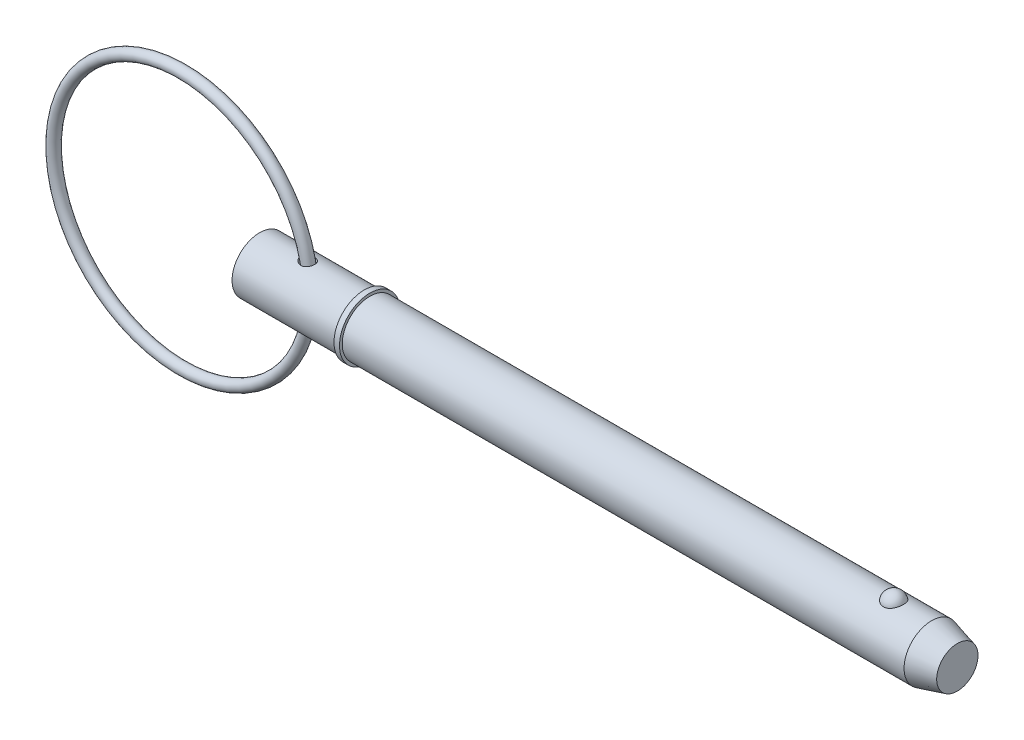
ISO-10303-21;
HEADER;
FILE_DESCRIPTION(('STEP AP214'),'2;1');
FILE_NAME('part.step','',(''),(''),'','','');
FILE_SCHEMA(('AUTOMOTIVE_DESIGN { 1 0 10303 214 1 1 1 1 }'));
ENDSEC;
DATA;
#1=APPLICATION_CONTEXT('core data for automotive mechanical design processes');
#2=APPLICATION_PROTOCOL_DEFINITION('international standard','automotive_design',2000,#1);
#3=PRODUCT_CONTEXT('',#1,'mechanical');
#4=PRODUCT('Part','Part','',(#3));
#5=PRODUCT_RELATED_PRODUCT_CATEGORY('part','',(#4));
#6=PRODUCT_DEFINITION_FORMATION('','',#4);
#7=PRODUCT_DEFINITION_CONTEXT('part definition',#1,'design');
#8=PRODUCT_DEFINITION('design','',#6,#7);
#9=PRODUCT_DEFINITION_SHAPE('','',#8);
#10=(LENGTH_UNIT() NAMED_UNIT(*) SI_UNIT(.MILLI.,.METRE.));
#11=(NAMED_UNIT(*) PLANE_ANGLE_UNIT() SI_UNIT($,.RADIAN.));
#12=(NAMED_UNIT(*) SI_UNIT($,.STERADIAN.) SOLID_ANGLE_UNIT());
#13=UNCERTAINTY_MEASURE_WITH_UNIT(LENGTH_MEASURE(1.E-05),#10,'distance_accuracy_value','');
#14=(GEOMETRIC_REPRESENTATION_CONTEXT(3) GLOBAL_UNCERTAINTY_ASSIGNED_CONTEXT((#13)) GLOBAL_UNIT_ASSIGNED_CONTEXT((#10,
#11,#12)) REPRESENTATION_CONTEXT('',''));
#15=CARTESIAN_POINT('',(0.,0.,0.));
#16=DIRECTION('',(0.,0.,1.));
#17=DIRECTION('',(1.,0.,0.));
#18=AXIS2_PLACEMENT_3D('',#15,#16,#17);
#19=CARTESIAN_POINT('',(-13.4013067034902,0.,0.));
#20=DIRECTION('',(0.,0.,1.));
#21=DIRECTION('',(1.,0.,0.));
#22=AXIS2_PLACEMENT_3D('',#19,#20,#21);
#23=TOROIDAL_SURFACE('',#22,22.225,0.952999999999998);
#24=CARTESIAN_POINT('',(9.77669329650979,0.,0.));
#25=VERTEX_POINT('',#24);
#26=VERTEX_LOOP('',#25);
#27=FACE_BOUND('',#26,.T.);
#28=ADVANCED_FACE('P0_F12',(#27),#23,.T.);
#29=CLOSED_SHELL('',(#28));
#30=MANIFOLD_SOLID_BREP('P0_B1',#29);
#31=CARTESIAN_POINT('',(0.,0.,0.));
#32=DIRECTION('',(1.,0.,0.));
#33=DIRECTION('',(0.,0.,-1.));
#34=AXIS2_PLACEMENT_3D('',#31,#32,#33);
#35=CYLINDRICAL_SURFACE('',#34,4.765);
#36=CARTESIAN_POINT('',(7.31773584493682,4.71580709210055,-0.682926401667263));
#37=CARTESIAN_POINT('',(7.3607471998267,4.70750812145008,-0.740230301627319));
#38=CARTESIAN_POINT('',(7.40883112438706,4.69869300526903,-0.79371122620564));
#39=CARTESIAN_POINT('',(7.51340999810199,4.68106981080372,-0.89180043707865));
#40=CARTESIAN_POINT('',(7.56991882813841,4.67226176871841,-0.936393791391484));
#41=CARTESIAN_POINT('',(7.689548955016,4.65568581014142,-1.01560363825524));
#42=CARTESIAN_POINT('',(7.75265928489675,4.64791621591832,-1.05023633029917));
#43=CARTESIAN_POINT('',(7.88387110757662,4.6343185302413,-1.10870278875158));
#44=CARTESIAN_POINT('',(7.95197058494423,4.62848966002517,-1.13254088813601));
#45=CARTESIAN_POINT('',(8.09209413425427,4.6194749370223,-1.16877415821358));
#46=CARTESIAN_POINT('',(8.16415141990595,4.6163169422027,-1.18104886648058));
#47=CARTESIAN_POINT('',(8.30937958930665,4.61324608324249,-1.19299123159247));
#48=CARTESIAN_POINT('',(8.38255011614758,4.61333220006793,-1.19266284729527));
#49=CARTESIAN_POINT('',(8.52374186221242,4.61674026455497,-1.17939593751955));
#50=CARTESIAN_POINT('',(8.59183022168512,4.61989017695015,-1.16712781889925));
#51=CARTESIAN_POINT('',(8.72470143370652,4.62884731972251,-1.13107903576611));
#52=CARTESIAN_POINT('',(8.78948513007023,4.63465386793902,-1.10730132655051));
#53=CARTESIAN_POINT('',(8.91088768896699,4.64792402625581,-1.05016249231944));
#54=CARTESIAN_POINT('',(8.96774302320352,4.65530108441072,-1.01728198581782));
#55=CARTESIAN_POINT('',(9.07499804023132,4.67102002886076,-0.942471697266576));
#56=CARTESIAN_POINT('',(9.12539777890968,4.6793619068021,-0.900541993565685));
#57=CARTESIAN_POINT('',(9.21836221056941,4.69607497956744,-0.808868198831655));
#58=CARTESIAN_POINT('',(9.26093651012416,4.70444612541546,-0.759133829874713));
#59=CARTESIAN_POINT('',(9.33728390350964,4.72032100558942,-0.653192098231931));
#60=CARTESIAN_POINT('',(9.3710564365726,4.72782468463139,-0.596984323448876));
#61=CARTESIAN_POINT('',(9.42940600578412,4.74126034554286,-0.478808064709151));
#62=CARTESIAN_POINT('',(9.45384681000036,4.74716869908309,-0.416769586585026));
#63=CARTESIAN_POINT('',(9.49226260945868,4.75663465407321,-0.289362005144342));
#64=CARTESIAN_POINT('',(9.50623742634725,4.76019221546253,-0.22399284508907));
#65=CARTESIAN_POINT('',(9.52342004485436,4.76458450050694,-0.0914886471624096));
#66=CARTESIAN_POINT('',(9.52658321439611,4.7654079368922,-0.0243474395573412));
#67=CARTESIAN_POINT('',(9.52194012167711,4.76421136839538,0.109528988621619));
#68=CARTESIAN_POINT('',(9.51413380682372,4.7621913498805,0.176264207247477));
#69=CARTESIAN_POINT('',(9.48775485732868,4.75552896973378,0.307367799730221));
#70=CARTESIAN_POINT('',(9.4691926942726,4.75088915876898,0.371738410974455));
#71=CARTESIAN_POINT('',(9.42175836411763,4.73949008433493,0.496364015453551));
#72=CARTESIAN_POINT('',(9.39288586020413,4.73273075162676,0.556618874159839));
#73=CARTESIAN_POINT('',(9.32549385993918,4.71782154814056,0.671371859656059));
#74=CARTESIAN_POINT('',(9.28696367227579,4.70967013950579,0.725863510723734));
#75=CARTESIAN_POINT('',(9.20123305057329,4.6928883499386,0.827453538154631));
#76=CARTESIAN_POINT('',(9.15403300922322,4.68425799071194,0.874552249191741));
#77=CARTESIAN_POINT('',(9.05250467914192,4.66754854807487,0.959736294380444));
#78=CARTESIAN_POINT('',(8.99822095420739,4.65946646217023,0.997874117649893));
#79=CARTESIAN_POINT('',(8.88381123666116,4.64472049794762,1.06440739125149));
#80=CARTESIAN_POINT('',(8.82368614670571,4.63805640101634,1.09280434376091));
#81=CARTESIAN_POINT('',(8.70022952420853,4.62698068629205,1.13878427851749));
#82=CARTESIAN_POINT('',(8.63695594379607,4.62253830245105,1.15651569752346));
#83=CARTESIAN_POINT('',(8.50825296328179,4.61622454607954,1.18146656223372));
#84=CARTESIAN_POINT('',(8.44282353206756,4.61435321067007,1.18868585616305));
#85=CARTESIAN_POINT('',(8.31119087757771,4.61332122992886,1.19268442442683));
#86=CARTESIAN_POINT('',(8.24498542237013,4.61417920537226,1.18939198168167));
#87=CARTESIAN_POINT('',(8.11397487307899,4.61847671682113,1.17259121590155));
#88=CARTESIAN_POINT('',(8.04917011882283,4.62191687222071,1.15908044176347));
#89=CARTESIAN_POINT('',(7.91946226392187,4.63117528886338,1.12153047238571));
#90=CARTESIAN_POINT('',(7.85470460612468,4.6371000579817,1.09701575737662));
#91=CARTESIAN_POINT('',(7.7300035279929,4.65063246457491,1.03814807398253));
#92=CARTESIAN_POINT('',(7.67006197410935,4.65824075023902,1.00379131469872));
#93=CARTESIAN_POINT('',(7.55352765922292,4.67473656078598,0.924015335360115));
#94=CARTESIAN_POINT('',(7.49726947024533,4.68366994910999,0.878115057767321));
#95=CARTESIAN_POINT('',(7.39344083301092,4.70144936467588,0.777311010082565));
#96=CARTESIAN_POINT('',(7.34587087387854,4.71029538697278,0.722406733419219));
#97=CARTESIAN_POINT('',(7.26188955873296,4.72669773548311,0.605773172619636));
#98=CARTESIAN_POINT('',(7.22531316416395,4.73427229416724,0.544165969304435));
#99=CARTESIAN_POINT('',(7.16406269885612,4.74732663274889,0.415095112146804));
#100=CARTESIAN_POINT('',(7.13937848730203,4.75280819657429,0.347636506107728));
#101=CARTESIAN_POINT('',(7.10494917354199,4.7605495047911,0.215359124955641));
#102=CARTESIAN_POINT('',(7.09405441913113,4.76305589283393,0.150853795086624));
#103=CARTESIAN_POINT('',(7.08387189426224,4.76539656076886,0.0208839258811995));
#104=CARTESIAN_POINT('',(7.0845805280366,4.76523166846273,-0.0445803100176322));
#105=CARTESIAN_POINT('',(7.09709111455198,4.76236014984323,-0.169693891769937));
#106=CARTESIAN_POINT('',(7.10810913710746,4.75983315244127,-0.229428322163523));
#107=CARTESIAN_POINT('',(7.13959099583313,4.75276726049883,-0.346187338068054));
#108=CARTESIAN_POINT('',(7.16004881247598,4.7482296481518,-0.403213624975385));
#109=CARTESIAN_POINT('',(7.20270325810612,4.73907067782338,-0.498040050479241));
#110=CARTESIAN_POINT('',(7.22286864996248,4.73481668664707,-0.536809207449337));
#111=CARTESIAN_POINT('',(7.26730952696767,4.72570777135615,-0.611832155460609));
#112=CARTESIAN_POINT('',(7.29158512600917,4.72085283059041,-0.64808587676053));
#113=CARTESIAN_POINT('',(7.31773584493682,4.71580709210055,-0.682926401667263));
#114=B_SPLINE_CURVE_WITH_KNOTS('',3,(#36,#37,#38,#39,#40,#41,#42,#43,#44,#45,#46,#47,#48,#49,
#50,#51,#52,#53,#54,#55,#56,#57,#58,#59,#60,#61,#62,#63,#64,#65,#66,#67,#68,#69,#70,#71,#72,#73,
#74,#75,#76,#77,#78,#79,#80,#81,#82,#83,#84,#85,#86,#87,#88,#89,#90,#91,#92,#93,#94,#95,#96,#97,
#98,#99,#100,#101,#102,#103,#104,#105,#106,#107,#108,#109,#110,#111,#112,#113),.UNSPECIFIED.,
.T.,.F.,(4,2,2,2,2,2,2,2,2,2,2,2,2,2,2,2,2,2,2,2,2,2,2,2,2,2,2,2,2,2,2,2,2,2,2,2,2,2,4),(0.,
0.216219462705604,0.432799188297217,0.649024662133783,0.865163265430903,1.08352938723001,
1.30182691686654,1.50853487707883,1.71518978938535,1.91252381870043,2.1098561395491,
2.30694457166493,2.50404555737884,2.70392296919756,2.90380378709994,3.10450875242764,
3.30521468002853,3.5057255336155,3.70624293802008,3.90698330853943,4.10771458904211,
4.30723900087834,4.50673262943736,4.70338139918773,4.90003300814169,5.09802914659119,
5.29607279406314,5.5036500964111,5.7113074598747,5.92972727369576,6.14815938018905,
6.36312650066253,6.57790998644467,6.77325899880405,6.96854747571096,7.15009726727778,
7.33153144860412,7.46298830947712,7.59444881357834),.UNSPECIFIED.);
#115=CARTESIAN_POINT('',(7.31773584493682,4.71580709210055,-0.682926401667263));
#116=VERTEX_POINT('',#115);
#117=EDGE_CURVE('P1_E42',#116,#116,#114,.T.);
#118=ORIENTED_EDGE('',*,*,#117,.T.);
#119=EDGE_LOOP('',(#118));
#120=FACE_BOUND('',#119,.T.);
#121=CARTESIAN_POINT('',(0.,0.,0.));
#122=DIRECTION('',(1.,0.,0.));
#123=DIRECTION('',(0.,0.,-1.));
#124=AXIS2_PLACEMENT_3D('',#121,#122,#123);
#125=CIRCLE('',#124,4.765);
#126=CARTESIAN_POINT('',(0.,0.,-4.765));
#127=VERTEX_POINT('',#126);
#128=EDGE_CURVE('P1_E9',#127,#127,#125,.T.);
#129=ORIENTED_EDGE('',*,*,#128,.T.);
#130=EDGE_LOOP('',(#129));
#131=FACE_BOUND('',#130,.T.);
#132=CARTESIAN_POINT('',(18.097,0.,0.));
#133=DIRECTION('',(1.,0.,0.));
#134=DIRECTION('',(0.,0.,-1.));
#135=AXIS2_PLACEMENT_3D('',#132,#133,#134);
#136=CIRCLE('',#135,4.765);
#137=CARTESIAN_POINT('',(18.097,0.,-4.765));
#138=VERTEX_POINT('',#137);
#139=EDGE_CURVE('P1_E25',#138,#138,#136,.T.);
#140=ORIENTED_EDGE('',*,*,#139,.F.);
#141=EDGE_LOOP('',(#140));
#142=FACE_BOUND('',#141,.T.);
#143=CARTESIAN_POINT('',(7.31773584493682,-4.71580709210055,-0.682926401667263));
#144=CARTESIAN_POINT('',(7.27956054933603,-4.72317282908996,-0.63206220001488));
#145=CARTESIAN_POINT('',(7.24535712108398,-4.7301361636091,-0.578155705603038));
#146=CARTESIAN_POINT('',(7.18611785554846,-4.74256090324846,-0.465352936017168));
#147=CARTESIAN_POINT('',(7.16107836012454,-4.74802290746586,-0.406458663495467));
#148=CARTESIAN_POINT('',(7.12119149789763,-4.75686558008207,-0.284913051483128));
#149=CARTESIAN_POINT('',(7.1063796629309,-4.76023898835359,-0.222249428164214));
#150=CARTESIAN_POINT('',(7.08786546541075,-4.76447177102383,-0.0952170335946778));
#151=CARTESIAN_POINT('',(7.08416018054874,-4.76533180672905,-0.0308487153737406));
#152=CARTESIAN_POINT('',(7.08795686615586,-4.76445764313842,0.0942755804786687));
#153=CARTESIAN_POINT('',(7.09490366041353,-4.762851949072,0.155050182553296));
#154=CARTESIAN_POINT('',(7.11863973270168,-4.75746086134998,0.2745356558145));
#155=CARTESIAN_POINT('',(7.13542953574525,-4.75367535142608,0.333246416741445));
#156=CARTESIAN_POINT('',(7.17817193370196,-4.74430545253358,0.447305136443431));
#157=CARTESIAN_POINT('',(7.20415836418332,-4.73871442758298,0.502639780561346));
#158=CARTESIAN_POINT('',(7.26428068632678,-4.72628508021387,0.608523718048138));
#159=CARTESIAN_POINT('',(7.29841897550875,-4.71944639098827,0.659071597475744));
#160=CARTESIAN_POINT('',(7.37680984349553,-4.70456239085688,0.758311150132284));
#161=CARTESIAN_POINT('',(7.42165519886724,-4.69646426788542,0.806526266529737));
#162=CARTESIAN_POINT('',(7.51828933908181,-4.68032890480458,0.895428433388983));
#163=CARTESIAN_POINT('',(7.57008134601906,-4.67229169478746,0.936111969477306));
#164=CARTESIAN_POINT('',(7.68397204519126,-4.65640659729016,1.01229731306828));
#165=CARTESIAN_POINT('',(7.74657226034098,-4.64863251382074,1.04706751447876));
#166=CARTESIAN_POINT('',(7.87680110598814,-4.6349740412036,1.10596507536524));
#167=CARTESIAN_POINT('',(7.94443054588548,-4.62908995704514,1.13009071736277));
#168=CARTESIAN_POINT('',(8.08402017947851,-4.61989019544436,1.16713943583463));
#169=CARTESIAN_POINT('',(8.15603143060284,-4.61661596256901,1.17988211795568));
#170=CARTESIAN_POINT('',(8.30124697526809,-4.61330446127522,1.1927680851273));
#171=CARTESIAN_POINT('',(8.37445077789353,-4.61326589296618,1.19291642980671));
#172=CARTESIAN_POINT('',(8.51584800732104,-4.61644036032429,1.18056687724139));
#173=CARTESIAN_POINT('',(8.58410302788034,-4.61948317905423,1.16873099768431));
#174=CARTESIAN_POINT('',(8.71738052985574,-4.6282520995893,1.13350536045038));
#175=CARTESIAN_POINT('',(8.78240382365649,-4.63397752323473,1.11011852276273));
#176=CARTESIAN_POINT('',(8.90428519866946,-4.64711877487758,1.05371003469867));
#177=CARTESIAN_POINT('',(8.96138096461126,-4.6544450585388,1.02117932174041));
#178=CARTESIAN_POINT('',(9.06916653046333,-4.6700970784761,0.947021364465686));
#179=CARTESIAN_POINT('',(9.11985639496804,-4.67842280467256,0.905394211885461));
#180=CARTESIAN_POINT('',(9.2134071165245,-4.69513303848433,0.814300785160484));
#181=CARTESIAN_POINT('',(9.25628268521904,-4.70351740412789,0.764849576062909));
#182=CARTESIAN_POINT('',(9.33327173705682,-4.71945185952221,0.659422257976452));
#183=CARTESIAN_POINT('',(9.3673846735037,-4.72700189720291,0.603445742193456));
#184=CARTESIAN_POINT('',(9.42645214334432,-4.74055953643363,0.485673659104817));
#185=CARTESIAN_POINT('',(9.45127042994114,-4.74654383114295,0.423807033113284));
#186=CARTESIAN_POINT('',(9.49046298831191,-4.756182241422,0.296676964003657));
#187=CARTESIAN_POINT('',(9.50483706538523,-4.75983631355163,0.231413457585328));
#188=CARTESIAN_POINT('',(9.52283408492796,-4.76443282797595,0.0990368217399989));
#189=CARTESIAN_POINT('',(9.52641016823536,-4.76536345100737,0.0319169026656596));
#190=CARTESIAN_POINT('',(9.52259067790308,-4.76437893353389,-0.101988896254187));
#191=CARTESIAN_POINT('',(9.5151950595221,-4.76246378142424,-0.168774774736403));
#192=CARTESIAN_POINT('',(9.48962516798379,-4.75599746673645,-0.300048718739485));
#193=CARTESIAN_POINT('',(9.4714615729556,-4.75144891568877,-0.364538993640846));
#194=CARTESIAN_POINT('',(9.42480303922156,-4.74020887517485,-0.489470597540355));
#195=CARTESIAN_POINT('',(9.396307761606,-4.73351731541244,-0.549911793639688));
#196=CARTESIAN_POINT('',(9.32963953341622,-4.71871240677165,-0.665099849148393));
#197=CARTESIAN_POINT('',(9.29145577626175,-4.71059747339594,-0.719840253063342));
#198=CARTESIAN_POINT('',(9.20637695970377,-4.69385254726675,-0.82198328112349));
#199=CARTESIAN_POINT('',(9.15948227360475,-4.68522257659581,-0.869386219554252));
#200=CARTESIAN_POINT('',(9.05849937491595,-4.66847516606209,-0.955233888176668));
#201=CARTESIAN_POINT('',(9.00445430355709,-4.6603550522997,-0.993728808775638));
#202=CARTESIAN_POINT('',(8.8904576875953,-4.64550122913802,-1.06100691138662));
#203=CARTESIAN_POINT('',(8.83050704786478,-4.63876730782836,-1.08979157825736));
#204=CARTESIAN_POINT('',(8.70732873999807,-4.6275305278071,-1.13655620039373));
#205=CARTESIAN_POINT('',(8.64416019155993,-4.62299714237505,-1.15468477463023));
#206=CARTESIAN_POINT('',(8.51559711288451,-4.61649071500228,-1.18043067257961));
#207=CARTESIAN_POINT('',(8.4502025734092,-4.61451768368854,-1.18804795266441));
#208=CARTESIAN_POINT('',(8.31862013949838,-4.61328355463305,-1.19283094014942));
#209=CARTESIAN_POINT('',(8.25242983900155,-4.61403911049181,-1.18993246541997));
#210=CARTESIAN_POINT('',(8.12138461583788,-4.61814057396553,-1.17391149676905));
#211=CARTESIAN_POINT('',(8.0565300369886,-4.62148714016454,-1.16078640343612));
#212=CARTESIAN_POINT('',(7.92669960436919,-4.63056912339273,-1.12402333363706));
#213=CARTESIAN_POINT('',(7.86186447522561,-4.63641051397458,-1.09991536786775));
#214=CARTESIAN_POINT('',(7.73694230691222,-4.64980121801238,-1.04185298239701));
#215=CARTESIAN_POINT('',(7.6768568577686,-4.65735110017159,-1.0078952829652));
#216=CARTESIAN_POINT('',(7.56207884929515,-4.67346080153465,-0.930364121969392));
#217=CARTESIAN_POINT('',(7.5074784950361,-4.68203382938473,-0.886656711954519));
#218=CARTESIAN_POINT('',(7.40624045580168,-4.69916824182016,-0.79082583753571));
#219=CARTESIAN_POINT('',(7.35959988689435,-4.7077296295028,-0.738705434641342));
#220=CARTESIAN_POINT('',(7.31773584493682,-4.71580709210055,-0.682926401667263));
#221=B_SPLINE_CURVE_WITH_KNOTS('',3,(#143,#144,#145,#146,#147,#148,#149,#150,#151,#152,#153,
#154,#155,#156,#157,#158,#159,#160,#161,#162,#163,#164,#165,#166,#167,#168,#169,#170,#171,#172,
#173,#174,#175,#176,#177,#178,#179,#180,#181,#182,#183,#184,#185,#186,#187,#188,#189,#190,#191,
#192,#193,#194,#195,#196,#197,#198,#199,#200,#201,#202,#203,#204,#205,#206,#207,#208,#209,#210,
#211,#212,#213,#214,#215,#216,#217,#218,#219,#220),.UNSPECIFIED.,.T.,.F.,(4,2,2,2,2,2,2,2,2,2,2,
2,2,2,2,2,2,2,2,2,2,2,2,2,2,2,2,2,2,2,2,2,2,2,2,2,2,2,4),(0.,0.191851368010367,0.38362606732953,
0.576063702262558,0.768450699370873,0.951145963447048,1.13385097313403,1.31723528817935,
1.50067360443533,1.69887079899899,1.8971602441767,2.11225870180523,2.32739185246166,
2.54587681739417,2.76427400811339,2.97123130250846,3.17813630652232,3.37555441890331,
3.57297054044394,3.77001106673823,3.96706388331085,4.16690159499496,4.36674303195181,
4.56745046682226,4.76815872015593,4.96866827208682,5.16918440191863,5.36992517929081,
5.5706573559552,5.77022940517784,5.96977092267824,6.16645904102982,6.36314797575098,
6.56103940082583,6.75898114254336,6.96633026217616,7.17374850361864,7.384214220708,
7.59460352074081),.UNSPECIFIED.);
#222=CARTESIAN_POINT('',(7.31773584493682,-4.71580709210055,-0.682926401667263));
#223=VERTEX_POINT('',#222);
#224=EDGE_CURVE('P1_E17',#223,#223,#221,.T.);
#225=ORIENTED_EDGE('',*,*,#224,.T.);
#226=EDGE_LOOP('',(#225));
#227=FACE_BOUND('',#226,.T.);
#228=ADVANCED_FACE('P1_F13',(#120,#131,#142,#227),#35,.T.);
#229=CARTESIAN_POINT('',(0.,0.,0.));
#230=DIRECTION('',(1.,0.,0.));
#231=DIRECTION('',(0.,0.,-1.));
#232=AXIS2_PLACEMENT_3D('',#229,#230,#231);
#233=CYLINDRICAL_SURFACE('',#232,4.765);
#234=CARTESIAN_POINT('',(116.204194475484,0.,0.));
#235=DIRECTION('',(1.,0.,0.));
#236=DIRECTION('',(0.,0.,-1.));
#237=AXIS2_PLACEMENT_3D('',#234,#235,#236);
#238=CIRCLE('',#237,4.765);
#239=CARTESIAN_POINT('',(116.204194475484,0.,-4.765));
#240=VERTEX_POINT('',#239);
#241=EDGE_CURVE('P1_E99',#240,#240,#238,.T.);
#242=ORIENTED_EDGE('',*,*,#241,.F.);
#243=EDGE_LOOP('',(#242));
#244=FACE_BOUND('',#243,.T.);
#245=CARTESIAN_POINT('',(19.05,0.,0.));
#246=DIRECTION('',(1.,0.,0.));
#247=DIRECTION('',(0.,0.,-1.));
#248=AXIS2_PLACEMENT_3D('',#245,#246,#247);
#249=CIRCLE('',#248,4.765);
#250=CARTESIAN_POINT('',(19.05,0.,-4.765));
#251=VERTEX_POINT('',#250);
#252=EDGE_CURVE('P1_E96',#251,#251,#249,.T.);
#253=ORIENTED_EDGE('',*,*,#252,.T.);
#254=EDGE_LOOP('',(#253));
#255=FACE_BOUND('',#254,.T.);
#256=CARTESIAN_POINT('',(109.651020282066,4.42764777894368,1.76101111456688));
#257=CARTESIAN_POINT('',(109.559721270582,4.42764470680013,1.76101422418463));
#258=CARTESIAN_POINT('',(109.468446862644,4.43059091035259,1.75366340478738));
#259=CARTESIAN_POINT('',(109.288615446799,4.44201846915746,1.72451180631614));
#260=CARTESIAN_POINT('',(109.200057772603,4.45049845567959,1.70271460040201));
#261=CARTESIAN_POINT('',(109.028257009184,4.47200516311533,1.6453937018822));
#262=CARTESIAN_POINT('',(108.945006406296,4.48502527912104,1.60988994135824));
#263=CARTESIAN_POINT('',(108.785763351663,4.51419542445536,1.52617873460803));
#264=CARTESIAN_POINT('',(108.709772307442,4.53034605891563,1.47796883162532));
#265=CARTESIAN_POINT('',(108.564744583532,4.5645931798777,1.36860494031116));
#266=CARTESIAN_POINT('',(108.495964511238,4.58273170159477,1.30712420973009));
#267=CARTESIAN_POINT('',(108.369342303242,4.61870302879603,1.17370204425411));
#268=CARTESIAN_POINT('',(108.311502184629,4.63653577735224,1.10175868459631));
#269=CARTESIAN_POINT('',(108.205570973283,4.67090140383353,0.945806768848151));
#270=CARTESIAN_POINT('',(108.158030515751,4.68734068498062,0.861402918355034));
#271=CARTESIAN_POINT('',(108.077081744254,4.71628466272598,0.685442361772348));
#272=CARTESIAN_POINT('',(108.043674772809,4.72878898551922,0.593884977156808));
#273=CARTESIAN_POINT('',(107.991287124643,4.74874061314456,0.404781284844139));
#274=CARTESIAN_POINT('',(107.972517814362,4.75611366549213,0.30716844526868));
#275=CARTESIAN_POINT('',(107.950584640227,4.76475393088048,0.109940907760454));
#276=CARTESIAN_POINT('',(107.947420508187,4.76602124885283,0.0103262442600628));
#277=CARTESIAN_POINT('',(107.956740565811,4.76232928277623,-0.187629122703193));
#278=CARTESIAN_POINT('',(107.969158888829,4.7573962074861,-0.285973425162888));
#279=CARTESIAN_POINT('',(108.009280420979,4.74184975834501,-0.479027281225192));
#280=CARTESIAN_POINT('',(108.036983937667,4.7312362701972,-0.573736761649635));
#281=CARTESIAN_POINT('',(108.107158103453,4.70540026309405,-0.756973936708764));
#282=CARTESIAN_POINT('',(108.149646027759,4.69017235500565,-0.845494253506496));
#283=CARTESIAN_POINT('',(108.248520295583,4.6566986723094,-1.01378033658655));
#284=CARTESIAN_POINT('',(108.304907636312,4.63845268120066,-1.09354547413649));
#285=CARTESIAN_POINT('',(108.430552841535,4.60085438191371,-1.24228523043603));
#286=CARTESIAN_POINT('',(108.499843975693,4.58149930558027,-1.31123108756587));
#287=CARTESIAN_POINT('',(108.649606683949,4.54391653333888,-1.43607409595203));
#288=CARTESIAN_POINT('',(108.730077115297,4.52568872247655,-1.49197257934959));
#289=CARTESIAN_POINT('',(108.898150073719,4.49293007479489,-1.58786764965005));
#290=CARTESIAN_POINT('',(108.985544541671,4.47832346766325,-1.62820219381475));
#291=CARTESIAN_POINT('',(109.166553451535,4.45406011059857,-1.69345757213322));
#292=CARTESIAN_POINT('',(109.26016555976,4.44440151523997,-1.71838415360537));
#293=CARTESIAN_POINT('',(109.445893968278,4.43159888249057,-1.75112843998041));
#294=CARTESIAN_POINT('',(109.537849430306,4.42815213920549,-1.75974223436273));
#295=CARTESIAN_POINT('',(109.721965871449,4.427247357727,-1.76201865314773));
#296=CARTESIAN_POINT('',(109.814126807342,4.42978816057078,-1.7556841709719));
#297=CARTESIAN_POINT('',(109.993129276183,4.4403864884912,-1.72869560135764));
#298=CARTESIAN_POINT('',(110.080047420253,4.44827555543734,-1.70847853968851));
#299=CARTESIAN_POINT('',(110.249131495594,4.46852246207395,-1.65479562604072));
#300=CARTESIAN_POINT('',(110.331297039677,4.48088066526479,-1.62132869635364));
#301=CARTESIAN_POINT('',(110.490591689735,4.50907357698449,-1.54120560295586));
#302=CARTESIAN_POINT('',(110.567570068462,4.52497884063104,-1.49427526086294));
#303=CARTESIAN_POINT('',(110.712708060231,4.55845148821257,-1.38881222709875));
#304=CARTESIAN_POINT('',(110.780865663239,4.57601924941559,-1.33027689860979));
#305=CARTESIAN_POINT('',(110.910099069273,4.61196537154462,-1.19991049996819));
#306=CARTESIAN_POINT('',(110.970656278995,4.63034074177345,-1.12756415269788));
#307=CARTESIAN_POINT('',(111.079279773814,4.66513959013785,-0.973612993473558));
#308=CARTESIAN_POINT('',(111.127343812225,4.68156271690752,-0.892006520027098));
#309=CARTESIAN_POINT('',(111.211383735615,4.71130224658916,-0.718892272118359));
#310=CARTESIAN_POINT('',(111.246918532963,4.724501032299,-0.627149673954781));
#311=CARTESIAN_POINT('',(111.302952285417,4.74571823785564,-0.438611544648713));
#312=CARTESIAN_POINT('',(111.323450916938,4.75373654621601,-0.341815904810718));
#313=CARTESIAN_POINT('',(111.349033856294,4.76378905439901,-0.145633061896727));
#314=CARTESIAN_POINT('',(111.354076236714,4.76580697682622,-0.046239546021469));
#315=CARTESIAN_POINT('',(111.348523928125,4.7636057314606,0.152038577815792));
#316=CARTESIAN_POINT('',(111.337929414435,4.75938663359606,0.250923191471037));
#317=CARTESIAN_POINT('',(111.301387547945,4.74516937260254,0.445004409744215));
#318=CARTESIAN_POINT('',(111.275496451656,4.73519238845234,0.54021317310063));
#319=CARTESIAN_POINT('',(111.208927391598,4.71049394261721,0.724662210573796));
#320=CARTESIAN_POINT('',(111.168248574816,4.69577220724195,0.81390214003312));
#321=CARTESIAN_POINT('',(111.072717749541,4.66303767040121,0.984313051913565));
#322=CARTESIAN_POINT('',(111.017804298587,4.64501070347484,1.06544688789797));
#323=CARTESIAN_POINT('',(110.895049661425,4.60764678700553,1.21692673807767));
#324=CARTESIAN_POINT('',(110.827208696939,4.58830985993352,1.2872729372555));
#325=CARTESIAN_POINT('',(110.680548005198,4.55060370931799,1.41479271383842));
#326=CARTESIAN_POINT('',(110.601791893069,4.53222967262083,1.47203785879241));
#327=CARTESIAN_POINT('',(110.434989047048,4.49849576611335,1.57212016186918));
#328=CARTESIAN_POINT('',(110.346941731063,4.48313608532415,1.61495641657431));
#329=CARTESIAN_POINT('',(110.159791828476,4.45676184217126,1.68642657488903));
#330=CARTESIAN_POINT('',(110.060365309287,4.44598302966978,1.71430590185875));
#331=CARTESIAN_POINT('',(109.857621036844,4.43142918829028,1.75159258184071));
#332=CARTESIAN_POINT('',(109.754304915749,4.42765125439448,1.76100759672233));
#333=CARTESIAN_POINT('',(109.651020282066,4.42764777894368,1.76101111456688));
#334=B_SPLINE_CURVE_WITH_KNOTS('',3,(#256,#257,#258,#259,#260,#261,#262,#263,#264,#265,#266,
#267,#268,#269,#270,#271,#272,#273,#274,#275,#276,#277,#278,#279,#280,#281,#282,#283,#284,#285,
#286,#287,#288,#289,#290,#291,#292,#293,#294,#295,#296,#297,#298,#299,#300,#301,#302,#303,#304,
#305,#306,#307,#308,#309,#310,#311,#312,#313,#314,#315,#316,#317,#318,#319,#320,#321,#322,#323,
#324,#325,#326,#327,#328,#329,#330,#331,#332,#333),.UNSPECIFIED.,.T.,.F.,(4,2,2,2,2,2,2,2,2,2,2,
2,2,2,2,2,2,2,2,2,2,2,2,2,2,2,2,2,2,2,2,2,2,2,2,2,2,2,4),(0.,0.273517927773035,
0.546968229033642,0.820022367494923,1.09312934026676,1.37393946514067,1.65480131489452,
1.94820420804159,2.24163496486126,2.53922817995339,2.8368162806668,3.13315071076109,
3.42949110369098,3.72617893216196,4.02288805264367,4.32037303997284,4.61782764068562,
4.90840095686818,5.19886582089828,5.4747485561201,5.75057789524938,6.01809977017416,
6.2856434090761,6.55907787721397,6.83257454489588,7.11962987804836,7.40673679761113,
7.70312663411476,7.99952284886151,8.29672237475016,8.59391856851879,8.89002850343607,
9.18615552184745,9.483582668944,9.78100471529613,10.0767610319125,10.3725358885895,
10.6820893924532,10.991514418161),.UNSPECIFIED.);
#335=CARTESIAN_POINT('',(109.651020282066,4.42764777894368,1.76101111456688));
#336=VERTEX_POINT('',#335);
#337=EDGE_CURVE('P1_E34',#336,#336,#334,.T.);
#338=ORIENTED_EDGE('',*,*,#337,.T.);
#339=EDGE_LOOP('',(#338));
#340=FACE_BOUND('',#339,.T.);
#341=ADVANCED_FACE('P1_F46',(#244,#255,#340),#233,.T.);
#342=CARTESIAN_POINT('',(0.,0.,0.));
#343=DIRECTION('',(-1.,0.,0.));
#344=DIRECTION('',(0.,0.,1.));
#345=AXIS2_PLACEMENT_3D('',#342,#343,#344);
#346=PLANE('',#345);
#347=ORIENTED_EDGE('',*,*,#128,.F.);
#348=EDGE_LOOP('',(#347));
#349=FACE_BOUND('',#348,.T.);
#350=ADVANCED_FACE('P1_F15',(#349),#346,.T.);
#351=CARTESIAN_POINT('',(18.097,4.765,0.));
#352=DIRECTION('',(-1.,0.,0.));
#353=DIRECTION('',(0.,0.,1.));
#354=AXIS2_PLACEMENT_3D('',#351,#352,#353);
#355=PLANE('',#354);
#356=ORIENTED_EDGE('',*,*,#139,.T.);
#357=EDGE_LOOP('',(#356));
#358=FACE_BOUND('',#357,.T.);
#359=CARTESIAN_POINT('',(18.097,0.,0.));
#360=DIRECTION('',(1.,0.,0.));
#361=DIRECTION('',(0.,0.,-1.));
#362=AXIS2_PLACEMENT_3D('',#359,#360,#361);
#363=CIRCLE('',#362,5.2415);
#364=CARTESIAN_POINT('',(18.097,0.,-5.2415));
#365=VERTEX_POINT('',#364);
#366=EDGE_CURVE('P1_E30',#365,#365,#363,.T.);
#367=ORIENTED_EDGE('',*,*,#366,.F.);
#368=EDGE_LOOP('',(#367));
#369=FACE_BOUND('',#368,.T.);
#370=ADVANCED_FACE('P1_F81',(#358,#369),#355,.T.);
#371=CARTESIAN_POINT('',(0.,0.,0.));
#372=DIRECTION('',(1.,0.,0.));
#373=DIRECTION('',(0.,0.,-1.));
#374=AXIS2_PLACEMENT_3D('',#371,#372,#373);
#375=CYLINDRICAL_SURFACE('',#374,5.2415);
#376=ORIENTED_EDGE('',*,*,#366,.T.);
#377=EDGE_LOOP('',(#376));
#378=FACE_BOUND('',#377,.T.);
#379=CARTESIAN_POINT('',(19.05,0.,0.));
#380=DIRECTION('',(1.,0.,0.));
#381=DIRECTION('',(0.,0.,-1.));
#382=AXIS2_PLACEMENT_3D('',#379,#380,#381);
#383=CIRCLE('',#382,5.2415);
#384=CARTESIAN_POINT('',(19.05,0.,-5.2415));
#385=VERTEX_POINT('',#384);
#386=EDGE_CURVE('P1_E95',#385,#385,#383,.T.);
#387=ORIENTED_EDGE('',*,*,#386,.F.);
#388=EDGE_LOOP('',(#387));
#389=FACE_BOUND('',#388,.T.);
#390=ADVANCED_FACE('P1_F68',(#378,#389),#375,.T.);
#391=CARTESIAN_POINT('',(19.05,5.2415,0.));
#392=DIRECTION('',(1.,0.,0.));
#393=DIRECTION('',(0.,0.,-1.));
#394=AXIS2_PLACEMENT_3D('',#391,#392,#393);
#395=PLANE('',#394);
#396=ORIENTED_EDGE('',*,*,#386,.T.);
#397=EDGE_LOOP('',(#396));
#398=FACE_BOUND('',#397,.T.);
#399=ORIENTED_EDGE('',*,*,#252,.F.);
#400=EDGE_LOOP('',(#399));
#401=FACE_BOUND('',#400,.T.);
#402=ADVANCED_FACE('P1_F62',(#398,#401),#395,.T.);
#403=CARTESIAN_POINT('',(120.65,0.,0.));
#404=DIRECTION('',(-1.,0.,0.));
#405=DIRECTION('',(0.,0.,1.));
#406=AXIS2_PLACEMENT_3D('',#403,#404,#405);
#407=CONICAL_SURFACE('',#406,3.57375000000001,0.26179938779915);
#408=ORIENTED_EDGE('',*,*,#241,.T.);
#409=EDGE_LOOP('',(#408));
#410=FACE_BOUND('',#409,.T.);
#411=CARTESIAN_POINT('',(120.65,0.,0.));
#412=DIRECTION('',(1.,0.,0.));
#413=DIRECTION('',(0.,0.,-1.));
#414=AXIS2_PLACEMENT_3D('',#411,#412,#413);
#415=CIRCLE('',#414,3.57375000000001);
#416=CARTESIAN_POINT('',(120.65,0.,-3.57375000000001));
#417=VERTEX_POINT('',#416);
#418=EDGE_CURVE('P1_E41',#417,#417,#415,.T.);
#419=ORIENTED_EDGE('',*,*,#418,.F.);
#420=EDGE_LOOP('',(#419));
#421=FACE_BOUND('',#420,.T.);
#422=ADVANCED_FACE('P1_F59',(#410,#421),#407,.T.);
#423=CARTESIAN_POINT('',(120.65,3.57375000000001,0.));
#424=DIRECTION('',(1.,0.,0.));
#425=DIRECTION('',(0.,0.,-1.));
#426=AXIS2_PLACEMENT_3D('',#423,#424,#425);
#427=PLANE('',#426);
#428=ORIENTED_EDGE('',*,*,#418,.T.);
#429=EDGE_LOOP('',(#428));
#430=FACE_BOUND('',#429,.T.);
#431=ADVANCED_FACE('P1_F55',(#430),#427,.T.);
#432=CARTESIAN_POINT('',(109.651020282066,4.2885,0.));
#433=DIRECTION('',(-1.,0.,0.));
#434=DIRECTION('',(0.,1.,0.));
#435=AXIS2_PLACEMENT_3D('',#432,#433,#434);
#436=SPHERICAL_SURFACE('',#435,1.7665);
#437=ORIENTED_EDGE('',*,*,#337,.F.);
#438=EDGE_LOOP('',(#437));
#439=FACE_BOUND('',#438,.T.);
#440=ADVANCED_FACE('P1_F50',(#439),#436,.T.);
#441=CARTESIAN_POINT('',(-13.4013067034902,0.,0.));
#442=DIRECTION('',(0.,0.,1.));
#443=DIRECTION('',(1.,0.,0.));
#444=AXIS2_PLACEMENT_3D('',#441,#442,#443);
#445=TOROIDAL_SURFACE('',#444,22.225,1.19125);
#446=ORIENTED_EDGE('',*,*,#224,.F.);
#447=EDGE_LOOP('',(#446));
#448=FACE_BOUND('',#447,.T.);
#449=ORIENTED_EDGE('',*,*,#117,.F.);
#450=EDGE_LOOP('',(#449));
#451=FACE_BOUND('',#450,.T.);
#452=ADVANCED_FACE('P1_F54',(#448,#451),#445,.F.);
#453=CLOSED_SHELL('',(#228,#341,#350,#370,#390,#402,#422,#431,#440,#452));
#454=MANIFOLD_SOLID_BREP('P1_B1',#453);
#455=ADVANCED_BREP_SHAPE_REPRESENTATION('',(#18,#30,#454),#14);
#456=SHAPE_DEFINITION_REPRESENTATION(#9,#455);
ENDSEC;
END-ISO-10303-21;
